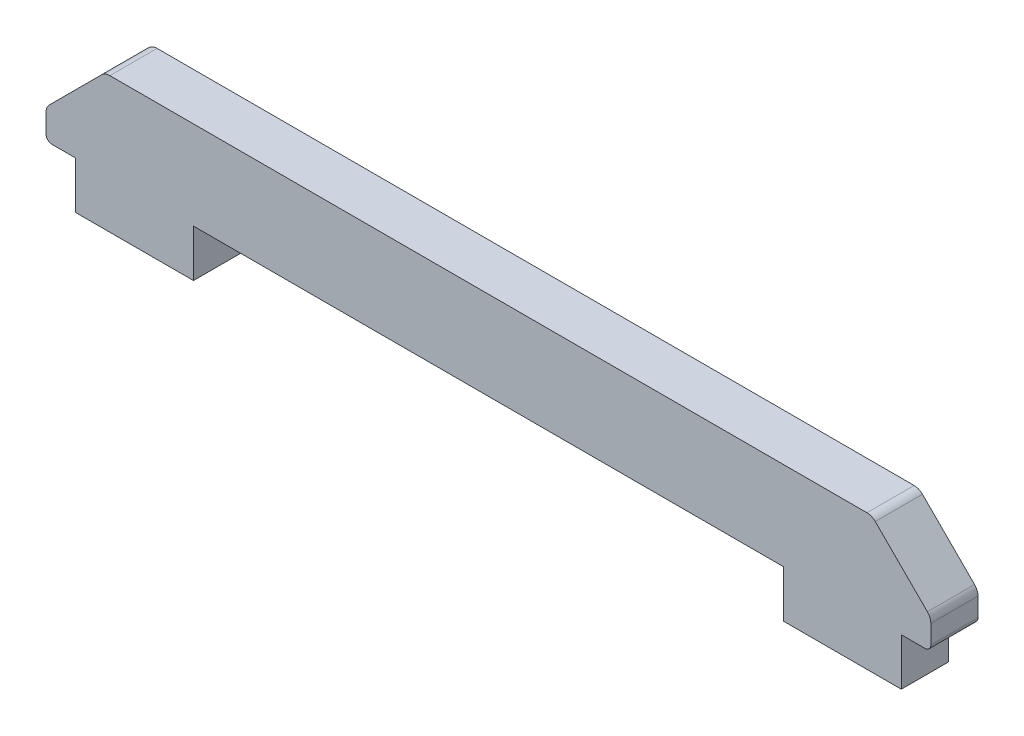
from build123d import *

# Parameters (mm, degrees)
BOSS_EXTRUDE1_DEPTH = 8


with BuildPart() as part:
    # Sketch1 → Boss-Extrude1 (new body)
    with BuildSketch(Plane.XY):
        with BuildLine():
            Line((140.585786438, -0.585786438), (149.414213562, -9.414213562))
            ThreePointArc((149.414213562, -9.414213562), (149.847759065, -10.06306026), (150, -10.828427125))
            Line((150, -10.828427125), (150, -14))
            ThreePointArc((150, -14), (149.707106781, -14.707106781), (149, -15))
            Line((149, -15), (145, -15))
            Line((145, -15), (145, -23))
            Line((145, -23), (125, -23))
            Line((125, -23), (125, -15))
            Line((125, -15), (25, -15))
            Line((25, -15), (25, -23))
            Line((25, -23), (5, -23))
            Line((5, -23), (5, -15))
            Line((5, -15), (1, -15))
            ThreePointArc((1, -15), (0.292893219, -14.707106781), (0, -14))
            Line((0, -14), (0, -10.828427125))
            ThreePointArc((0, -10.828427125), (0.152240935, -10.06306026), (0.585786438, -9.414213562))
            Line((0.585786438, -9.414213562), (9.414213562, -0.585786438))
            ThreePointArc((9.414213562, -0.585786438), (10.06306026, -0.152240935), (10.828427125, 0))
            Line((10.828427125, 0), (139.171572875, 0))
            ThreePointArc((139.171572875, 0), (139.93693974, -0.152240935), (140.585786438, -0.585786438))
        make_face()
    extrude(amount=BOSS_EXTRUDE1_DEPTH)


solid = part.part
